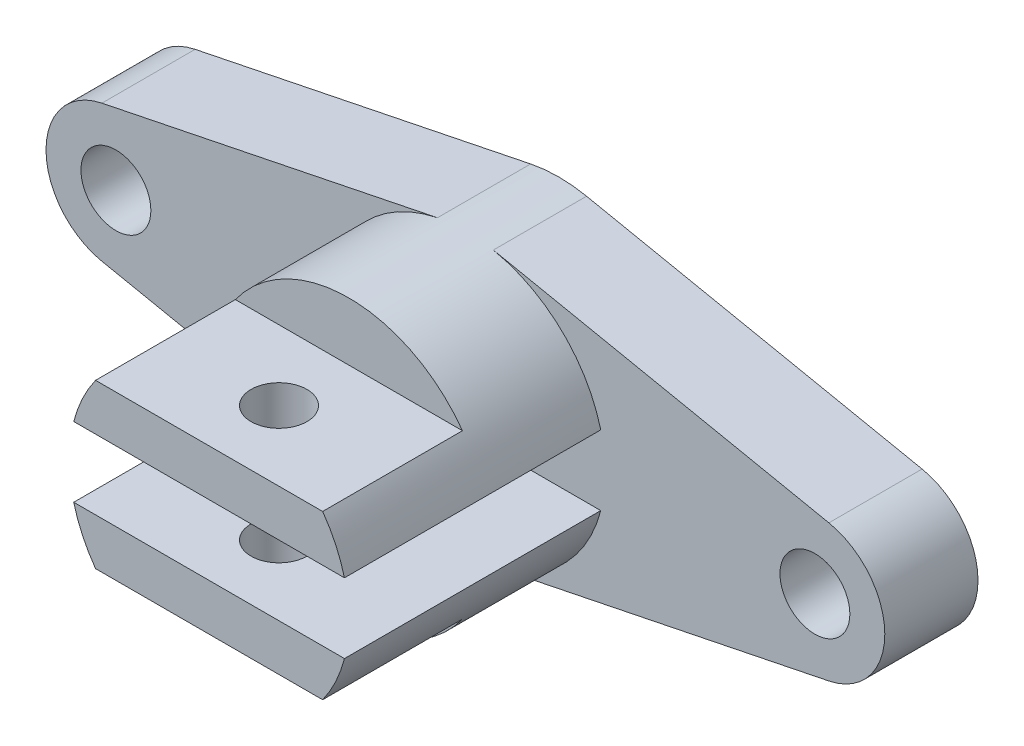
ISO-10303-21;
HEADER;
FILE_DESCRIPTION(('STEP AP214'),'2;1');
FILE_NAME('part.step','',(''),(''),'','','');
FILE_SCHEMA(('AUTOMOTIVE_DESIGN { 1 0 10303 214 1 1 1 1 }'));
ENDSEC;
DATA;
#1=APPLICATION_CONTEXT('core data for automotive mechanical design processes');
#2=APPLICATION_PROTOCOL_DEFINITION('international standard','automotive_design',2000,#1);
#3=PRODUCT_CONTEXT('',#1,'mechanical');
#4=PRODUCT('Part','Part','',(#3));
#5=PRODUCT_RELATED_PRODUCT_CATEGORY('part','',(#4));
#6=PRODUCT_DEFINITION_FORMATION('','',#4);
#7=PRODUCT_DEFINITION_CONTEXT('part definition',#1,'design');
#8=PRODUCT_DEFINITION('design','',#6,#7);
#9=PRODUCT_DEFINITION_SHAPE('','',#8);
#10=(LENGTH_UNIT() NAMED_UNIT(*) SI_UNIT(.MILLI.,.METRE.));
#11=(NAMED_UNIT(*) PLANE_ANGLE_UNIT() SI_UNIT($,.RADIAN.));
#12=(NAMED_UNIT(*) SI_UNIT($,.STERADIAN.) SOLID_ANGLE_UNIT());
#13=UNCERTAINTY_MEASURE_WITH_UNIT(LENGTH_MEASURE(1.E-05),#10,'distance_accuracy_value','');
#14=(GEOMETRIC_REPRESENTATION_CONTEXT(3) GLOBAL_UNCERTAINTY_ASSIGNED_CONTEXT((#13)) GLOBAL_UNIT_ASSIGNED_CONTEXT((#10,
#11,#12)) REPRESENTATION_CONTEXT('',''));
#15=CARTESIAN_POINT('',(0.,0.,0.));
#16=DIRECTION('',(0.,0.,1.));
#17=DIRECTION('',(1.,0.,0.));
#18=AXIS2_PLACEMENT_3D('',#15,#16,#17);
#19=CARTESIAN_POINT('',(0.,0.,45.));
#20=DIRECTION('',(0.,0.,1.));
#21=DIRECTION('',(1.,0.,0.));
#22=AXIS2_PLACEMENT_3D('',#19,#20,#21);
#23=PLANE('',#22);
#24=CARTESIAN_POINT('',(0.,0.,45.));
#25=DIRECTION('',(0.,0.,1.));
#26=DIRECTION('',(1.,0.,0.));
#27=AXIS2_PLACEMENT_3D('',#24,#25,#26);
#28=CIRCLE('',#27,29.9999999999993);
#29=CARTESIAN_POINT('',(-24.3669858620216,-17.5000000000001,45.));
#30=VERTEX_POINT('',#29);
#31=CARTESIAN_POINT('',(24.3669858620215,-17.5000000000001,45.));
#32=VERTEX_POINT('',#31);
#33=EDGE_CURVE('E228',#30,#32,#28,.T.);
#34=ORIENTED_EDGE('',*,*,#33,.T.);
#35=DIRECTION('',(-1.,0.,0.));
#36=VECTOR('',#35,1.);
#37=CARTESIAN_POINT('',(0.,-17.5000000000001,45.));
#38=LINE('',#37,#36);
#39=EDGE_CURVE('E11',#32,#30,#38,.T.);
#40=ORIENTED_EDGE('',*,*,#39,.T.);
#41=EDGE_LOOP('',(#34,#40));
#42=FACE_BOUND('',#41,.T.);
#43=ADVANCED_FACE('F47',(#42),#23,.T.);
#44=CARTESIAN_POINT('',(0.,0.,20.));
#45=DIRECTION('',(0.,0.,-1.));
#46=DIRECTION('',(-1.,0.,0.));
#47=AXIS2_PLACEMENT_3D('',#44,#45,#46);
#48=CYLINDRICAL_SURFACE('',#47,29.9999999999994);
#49=CARTESIAN_POINT('',(0.,0.,45.));
#50=DIRECTION('',(0.,0.,1.));
#51=DIRECTION('',(1.,0.,0.));
#52=AXIS2_PLACEMENT_3D('',#49,#50,#51);
#53=CIRCLE('',#52,29.9999999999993);
#54=CARTESIAN_POINT('',(24.3669858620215,17.5,45.));
#55=VERTEX_POINT('',#54);
#56=CARTESIAN_POINT('',(-24.3669858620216,17.5,45.));
#57=VERTEX_POINT('',#56);
#58=EDGE_CURVE('E174',#55,#57,#53,.T.);
#59=ORIENTED_EDGE('',*,*,#58,.F.);
#60=DIRECTION('',(0.,0.,-1.));
#61=VECTOR('',#60,1.);
#62=CARTESIAN_POINT('',(24.3669858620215,17.5,75.));
#63=LINE('',#62,#61);
#64=CARTESIAN_POINT('',(24.3669858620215,17.5,75.));
#65=VERTEX_POINT('',#64);
#66=EDGE_CURVE('E205',#65,#55,#63,.T.);
#67=ORIENTED_EDGE('',*,*,#66,.F.);
#68=CARTESIAN_POINT('',(0.,0.,75.));
#69=DIRECTION('',(0.,0.,1.));
#70=DIRECTION('',(1.,0.,0.));
#71=AXIS2_PLACEMENT_3D('',#68,#69,#70);
#72=CIRCLE('',#71,29.9999999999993);
#73=CARTESIAN_POINT('',(29.0473750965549,7.5,75.));
#74=VERTEX_POINT('',#73);
#75=EDGE_CURVE('E182',#74,#65,#72,.T.);
#76=ORIENTED_EDGE('',*,*,#75,.F.);
#77=DIRECTION('',(0.,0.,-1.));
#78=VECTOR('',#77,1.);
#79=CARTESIAN_POINT('',(29.0473750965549,7.50000000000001,45.));
#80=LINE('',#79,#78);
#81=CARTESIAN_POINT('',(29.0473750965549,7.50000000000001,20.));
#82=VERTEX_POINT('',#81);
#83=EDGE_CURVE('E173',#74,#82,#80,.T.);
#84=ORIENTED_EDGE('',*,*,#83,.T.);
#85=CARTESIAN_POINT('',(0.,0.,20.));
#86=DIRECTION('',(0.,0.,1.));
#87=DIRECTION('',(1.,0.,0.));
#88=AXIS2_PLACEMENT_3D('',#85,#86,#87);
#89=CIRCLE('',#88,29.9999999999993);
#90=CARTESIAN_POINT('',(5.99999999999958,29.3938769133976,20.));
#91=VERTEX_POINT('',#90);
#92=EDGE_CURVE('E70',#91,#82,#89,.F.);
#93=ORIENTED_EDGE('',*,*,#92,.F.);
#94=DIRECTION('',(0.,0.,-1.));
#95=VECTOR('',#94,1.);
#96=CARTESIAN_POINT('',(5.99999999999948,29.3938769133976,20.));
#97=LINE('',#96,#95);
#98=CARTESIAN_POINT('',(5.99999999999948,29.3938769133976,0.));
#99=VERTEX_POINT('',#98);
#100=EDGE_CURVE('E295',#91,#99,#97,.T.);
#101=ORIENTED_EDGE('',*,*,#100,.T.);
#102=CARTESIAN_POINT('',(0.,0.,0.));
#103=DIRECTION('',(0.,0.,1.));
#104=DIRECTION('',(1.,0.,0.));
#105=AXIS2_PLACEMENT_3D('',#102,#103,#104);
#106=CIRCLE('',#105,29.9999999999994);
#107=CARTESIAN_POINT('',(-6.00000000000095,29.3938769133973,0.));
#108=VERTEX_POINT('',#107);
#109=EDGE_CURVE('E268',#99,#108,#106,.T.);
#110=ORIENTED_EDGE('',*,*,#109,.T.);
#111=DIRECTION('',(0.,0.,-1.));
#112=VECTOR('',#111,1.);
#113=CARTESIAN_POINT('',(-6.00000000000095,29.3938769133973,20.));
#114=LINE('',#113,#112);
#115=CARTESIAN_POINT('',(-6.00000000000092,29.3938769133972,20.));
#116=VERTEX_POINT('',#115);
#117=EDGE_CURVE('E346',#116,#108,#114,.T.);
#118=ORIENTED_EDGE('',*,*,#117,.F.);
#119=CARTESIAN_POINT('',(-29.0473750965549,7.5,20.));
#120=VERTEX_POINT('',#119);
#121=EDGE_CURVE('E169',#120,#116,#89,.F.);
#122=ORIENTED_EDGE('',*,*,#121,.F.);
#123=DIRECTION('',(0.,0.,-1.));
#124=VECTOR('',#123,1.);
#125=CARTESIAN_POINT('',(-29.0473750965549,7.5,45.));
#126=LINE('',#125,#124);
#127=CARTESIAN_POINT('',(-29.0473750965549,7.5,75.));
#128=VERTEX_POINT('',#127);
#129=EDGE_CURVE('E162',#128,#120,#126,.T.);
#130=ORIENTED_EDGE('',*,*,#129,.F.);
#131=CARTESIAN_POINT('',(0.,0.,75.));
#132=DIRECTION('',(0.,0.,1.));
#133=DIRECTION('',(1.,0.,0.));
#134=AXIS2_PLACEMENT_3D('',#131,#132,#133);
#135=CIRCLE('',#134,29.9999999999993);
#136=CARTESIAN_POINT('',(-24.3669858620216,17.5,75.));
#137=VERTEX_POINT('',#136);
#138=EDGE_CURVE('E166',#137,#128,#135,.T.);
#139=ORIENTED_EDGE('',*,*,#138,.F.);
#140=DIRECTION('',(0.,0.,-1.));
#141=VECTOR('',#140,1.);
#142=CARTESIAN_POINT('',(-24.3669858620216,17.5,75.));
#143=LINE('',#142,#141);
#144=EDGE_CURVE('E202',#137,#57,#143,.T.);
#145=ORIENTED_EDGE('',*,*,#144,.T.);
#146=EDGE_LOOP('',(#59,#67,#76,#84,#93,#101,#110,#118,#122,#130,#139,#145));
#147=FACE_BOUND('',#146,.T.);
#148=ADVANCED_FACE('F49',(#147),#48,.T.);
#149=CARTESIAN_POINT('',(-78.0000000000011,14.6969384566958,20.));
#150=DIRECTION('',(-0.200000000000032,0.979795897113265,0.));
#151=DIRECTION('',(-0.979795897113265,-0.200000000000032,0.));
#152=AXIS2_PLACEMENT_3D('',#149,#150,#151);
#153=PLANE('',#152);
#154=DIRECTION('',(0.979795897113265,0.200000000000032,0.));
#155=VECTOR('',#154,1.);
#156=CARTESIAN_POINT('',(-78.0000000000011,14.6969384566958,0.));
#157=LINE('',#156,#155);
#158=CARTESIAN_POINT('',(-78.0000000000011,14.6969384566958,0.));
#159=VERTEX_POINT('',#158);
#160=EDGE_CURVE('E299',#159,#108,#157,.T.);
#161=ORIENTED_EDGE('',*,*,#160,.F.);
#162=DIRECTION('',(0.,0.,-1.));
#163=VECTOR('',#162,1.);
#164=CARTESIAN_POINT('',(-78.0000000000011,14.6969384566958,20.));
#165=LINE('',#164,#163);
#166=CARTESIAN_POINT('',(-78.0000000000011,14.6969384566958,20.));
#167=VERTEX_POINT('',#166);
#168=EDGE_CURVE('E343',#167,#159,#165,.T.);
#169=ORIENTED_EDGE('',*,*,#168,.F.);
#170=DIRECTION('',(0.979795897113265,0.200000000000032,0.));
#171=VECTOR('',#170,1.);
#172=CARTESIAN_POINT('',(-78.0000000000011,14.6969384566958,20.));
#173=LINE('',#172,#171);
#174=EDGE_CURVE('E272',#167,#116,#173,.T.);
#175=ORIENTED_EDGE('',*,*,#174,.T.);
#176=ORIENTED_EDGE('',*,*,#117,.T.);
#177=EDGE_LOOP('',(#161,#169,#175,#176));
#178=FACE_BOUND('',#177,.T.);
#179=ADVANCED_FACE('F375',(#178),#153,.T.);
#180=CARTESIAN_POINT('',(-75.0000000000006,-3.15973077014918E-12,20.));
#181=DIRECTION('',(0.,0.,-1.));
#182=DIRECTION('',(-1.,0.,0.));
#183=AXIS2_PLACEMENT_3D('',#180,#181,#182);
#184=CYLINDRICAL_SURFACE('',#183,15.);
#185=CARTESIAN_POINT('',(-75.0000000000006,-3.15973077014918E-12,0.));
#186=DIRECTION('',(0.,0.,1.));
#187=DIRECTION('',(1.,0.,0.));
#188=AXIS2_PLACEMENT_3D('',#185,#186,#187);
#189=CIRCLE('',#188,15.);
#190=CARTESIAN_POINT('',(-77.9999999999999,-14.6969384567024,0.));
#191=VERTEX_POINT('',#190);
#192=EDGE_CURVE('E303',#159,#191,#189,.T.);
#193=ORIENTED_EDGE('',*,*,#192,.T.);
#194=DIRECTION('',(0.,0.,-1.));
#195=VECTOR('',#194,1.);
#196=CARTESIAN_POINT('',(-77.9999999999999,-14.6969384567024,20.));
#197=LINE('',#196,#195);
#198=CARTESIAN_POINT('',(-77.9999999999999,-14.6969384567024,20.));
#199=VERTEX_POINT('',#198);
#200=EDGE_CURVE('E339',#199,#191,#197,.T.);
#201=ORIENTED_EDGE('',*,*,#200,.F.);
#202=CARTESIAN_POINT('',(-75.0000000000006,-3.15973077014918E-12,20.));
#203=DIRECTION('',(0.,0.,1.));
#204=DIRECTION('',(1.,0.,0.));
#205=AXIS2_PLACEMENT_3D('',#202,#203,#204);
#206=CIRCLE('',#205,15.);
#207=EDGE_CURVE('E276',#167,#199,#206,.T.);
#208=ORIENTED_EDGE('',*,*,#207,.F.);
#209=ORIENTED_EDGE('',*,*,#168,.T.);
#210=EDGE_LOOP('',(#193,#201,#208,#209));
#211=FACE_BOUND('',#210,.T.);
#212=ADVANCED_FACE('F411',(#211),#184,.T.);
#213=CARTESIAN_POINT('',(-77.9999999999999,-14.6969384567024,20.));
#214=DIRECTION('',(0.199999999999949,0.979795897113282,0.));
#215=DIRECTION('',(-0.979795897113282,0.199999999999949,0.));
#216=AXIS2_PLACEMENT_3D('',#213,#214,#215);
#217=PLANE('',#216);
#218=DIRECTION('',(0.979795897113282,-0.199999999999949,0.));
#219=VECTOR('',#218,1.);
#220=CARTESIAN_POINT('',(-77.9999999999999,-14.6969384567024,0.));
#221=LINE('',#220,#219);
#222=CARTESIAN_POINT('',(-5.99999999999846,-29.3938769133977,0.));
#223=VERTEX_POINT('',#222);
#224=EDGE_CURVE('E306',#191,#223,#221,.T.);
#225=ORIENTED_EDGE('',*,*,#224,.T.);
#226=DIRECTION('',(0.,0.,-1.));
#227=VECTOR('',#226,1.);
#228=CARTESIAN_POINT('',(-5.99999999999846,-29.3938769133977,20.));
#229=LINE('',#228,#227);
#230=CARTESIAN_POINT('',(-5.99999999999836,-29.3938769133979,20.));
#231=VERTEX_POINT('',#230);
#232=EDGE_CURVE('E335',#231,#223,#229,.T.);
#233=ORIENTED_EDGE('',*,*,#232,.F.);
#234=DIRECTION('',(0.979795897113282,-0.199999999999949,0.));
#235=VECTOR('',#234,1.);
#236=CARTESIAN_POINT('',(-77.9999999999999,-14.6969384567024,20.));
#237=LINE('',#236,#235);
#238=EDGE_CURVE('E280',#199,#231,#237,.T.);
#239=ORIENTED_EDGE('',*,*,#238,.F.);
#240=ORIENTED_EDGE('',*,*,#200,.T.);
#241=EDGE_LOOP('',(#225,#233,#239,#240));
#242=FACE_BOUND('',#241,.T.);
#243=ADVANCED_FACE('F407',(#242),#217,.F.);
#244=CARTESIAN_POINT('',(0.,0.,20.));
#245=DIRECTION('',(0.,0.,-1.));
#246=DIRECTION('',(-1.,0.,0.));
#247=AXIS2_PLACEMENT_3D('',#244,#245,#246);
#248=CYLINDRICAL_SURFACE('',#247,29.9999999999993);
#249=DIRECTION('',(0.,0.,-1.));
#250=VECTOR('',#249,1.);
#251=CARTESIAN_POINT('',(-29.0473750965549,-7.49999999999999,45.));
#252=LINE('',#251,#250);
#253=CARTESIAN_POINT('',(-29.0473750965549,-7.5,75.));
#254=VERTEX_POINT('',#253);
#255=CARTESIAN_POINT('',(-29.0473750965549,-7.49999999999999,20.));
#256=VERTEX_POINT('',#255);
#257=EDGE_CURVE('E209',#254,#256,#252,.T.);
#258=ORIENTED_EDGE('',*,*,#257,.T.);
#259=CARTESIAN_POINT('',(0.,0.,20.));
#260=DIRECTION('',(0.,0.,1.));
#261=DIRECTION('',(1.,0.,0.));
#262=AXIS2_PLACEMENT_3D('',#259,#260,#261);
#263=CIRCLE('',#262,29.9999999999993);
#264=EDGE_CURVE('E245',#231,#256,#263,.F.);
#265=ORIENTED_EDGE('',*,*,#264,.F.);
#266=ORIENTED_EDGE('',*,*,#232,.T.);
#267=CARTESIAN_POINT('',(0.,0.,0.));
#268=DIRECTION('',(0.,0.,1.));
#269=DIRECTION('',(1.,0.,0.));
#270=AXIS2_PLACEMENT_3D('',#267,#268,#269);
#271=CIRCLE('',#270,29.9999999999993);
#272=CARTESIAN_POINT('',(5.99999999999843,-29.3938769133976,0.));
#273=VERTEX_POINT('',#272);
#274=EDGE_CURVE('E309',#223,#273,#271,.T.);
#275=ORIENTED_EDGE('',*,*,#274,.T.);
#276=DIRECTION('',(0.,0.,-1.));
#277=VECTOR('',#276,1.);
#278=CARTESIAN_POINT('',(5.99999999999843,-29.3938769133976,20.));
#279=LINE('',#278,#277);
#280=CARTESIAN_POINT('',(5.99999999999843,-29.3938769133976,20.));
#281=VERTEX_POINT('',#280);
#282=EDGE_CURVE('E332',#281,#273,#279,.T.);
#283=ORIENTED_EDGE('',*,*,#282,.F.);
#284=CARTESIAN_POINT('',(29.0473750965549,-7.50000000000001,20.));
#285=VERTEX_POINT('',#284);
#286=EDGE_CURVE('E232',#285,#281,#263,.F.);
#287=ORIENTED_EDGE('',*,*,#286,.F.);
#288=DIRECTION('',(0.,0.,-1.));
#289=VECTOR('',#288,1.);
#290=CARTESIAN_POINT('',(29.0473750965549,-7.50000000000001,45.));
#291=LINE('',#290,#289);
#292=CARTESIAN_POINT('',(29.0473750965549,-7.5,75.));
#293=VERTEX_POINT('',#292);
#294=EDGE_CURVE('E233',#293,#285,#291,.T.);
#295=ORIENTED_EDGE('',*,*,#294,.F.);
#296=CARTESIAN_POINT('',(0.,0.,75.));
#297=DIRECTION('',(0.,0.,1.));
#298=DIRECTION('',(1.,0.,0.));
#299=AXIS2_PLACEMENT_3D('',#296,#297,#298);
#300=CIRCLE('',#299,29.9999999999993);
#301=CARTESIAN_POINT('',(24.3669858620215,-17.5000000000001,75.));
#302=VERTEX_POINT('',#301);
#303=EDGE_CURVE('E221',#302,#293,#300,.T.);
#304=ORIENTED_EDGE('',*,*,#303,.F.);
#305=DIRECTION('',(0.,0.,-1.));
#306=VECTOR('',#305,1.);
#307=CARTESIAN_POINT('',(24.3669858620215,-17.5000000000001,75.));
#308=LINE('',#307,#306);
#309=EDGE_CURVE('E213',#302,#32,#308,.T.);
#310=ORIENTED_EDGE('',*,*,#309,.T.);
#311=ORIENTED_EDGE('',*,*,#33,.F.);
#312=DIRECTION('',(0.,0.,-1.));
#313=VECTOR('',#312,1.);
#314=CARTESIAN_POINT('',(-24.3669858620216,-17.5000000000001,75.));
#315=LINE('',#314,#313);
#316=CARTESIAN_POINT('',(-24.3669858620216,-17.5000000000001,75.));
#317=VERTEX_POINT('',#316);
#318=EDGE_CURVE('E210',#317,#30,#315,.T.);
#319=ORIENTED_EDGE('',*,*,#318,.F.);
#320=CARTESIAN_POINT('',(0.,0.,75.));
#321=DIRECTION('',(0.,0.,1.));
#322=DIRECTION('',(1.,0.,0.));
#323=AXIS2_PLACEMENT_3D('',#320,#321,#322);
#324=CIRCLE('',#323,29.9999999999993);
#325=EDGE_CURVE('E188',#254,#317,#324,.T.);
#326=ORIENTED_EDGE('',*,*,#325,.F.);
#327=EDGE_LOOP('',(#258,#265,#266,#275,#283,#287,#295,#304,#310,#311,#319,#326));
#328=FACE_BOUND('',#327,.T.);
#329=ADVANCED_FACE('F403',(#328),#248,.T.);
#330=CARTESIAN_POINT('',(78.0000000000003,-14.6969384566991,20.));
#331=DIRECTION('',(0.199999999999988,-0.979795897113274,0.));
#332=DIRECTION('',(0.979795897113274,0.199999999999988,0.));
#333=AXIS2_PLACEMENT_3D('',#330,#331,#332);
#334=PLANE('',#333);
#335=DIRECTION('',(-0.979795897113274,-0.199999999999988,0.));
#336=VECTOR('',#335,1.);
#337=CARTESIAN_POINT('',(78.0000000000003,-14.6969384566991,0.));
#338=LINE('',#337,#336);
#339=CARTESIAN_POINT('',(78.0000000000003,-14.6969384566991,0.));
#340=VERTEX_POINT('',#339);
#341=EDGE_CURVE('E313',#340,#273,#338,.T.);
#342=ORIENTED_EDGE('',*,*,#341,.F.);
#343=DIRECTION('',(0.,0.,-1.));
#344=VECTOR('',#343,1.);
#345=CARTESIAN_POINT('',(78.0000000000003,-14.6969384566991,20.));
#346=LINE('',#345,#344);
#347=CARTESIAN_POINT('',(78.0000000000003,-14.6969384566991,20.));
#348=VERTEX_POINT('',#347);
#349=EDGE_CURVE('E329',#348,#340,#346,.T.);
#350=ORIENTED_EDGE('',*,*,#349,.F.);
#351=DIRECTION('',(-0.979795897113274,-0.199999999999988,0.));
#352=VECTOR('',#351,1.);
#353=CARTESIAN_POINT('',(78.0000000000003,-14.6969384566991,20.));
#354=LINE('',#353,#352);
#355=EDGE_CURVE('E284',#348,#281,#354,.T.);
#356=ORIENTED_EDGE('',*,*,#355,.T.);
#357=ORIENTED_EDGE('',*,*,#282,.T.);
#358=EDGE_LOOP('',(#342,#350,#356,#357));
#359=FACE_BOUND('',#358,.T.);
#360=ADVANCED_FACE('F399',(#359),#334,.T.);
#361=CARTESIAN_POINT('',(74.9999999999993,0.,20.));
#362=DIRECTION('',(0.,0.,-1.));
#363=DIRECTION('',(-1.,0.,0.));
#364=AXIS2_PLACEMENT_3D('',#361,#362,#363);
#365=CYLINDRICAL_SURFACE('',#364,15.0000000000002);
#366=CARTESIAN_POINT('',(74.9999999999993,0.,0.));
#367=DIRECTION('',(0.,0.,1.));
#368=DIRECTION('',(1.,0.,0.));
#369=AXIS2_PLACEMENT_3D('',#366,#367,#368);
#370=CIRCLE('',#369,15.0000000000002);
#371=CARTESIAN_POINT('',(78.0000000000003,14.6969384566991,0.));
#372=VERTEX_POINT('',#371);
#373=EDGE_CURVE('E317',#340,#372,#370,.T.);
#374=ORIENTED_EDGE('',*,*,#373,.T.);
#375=DIRECTION('',(0.,0.,-1.));
#376=VECTOR('',#375,1.);
#377=CARTESIAN_POINT('',(78.0000000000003,14.6969384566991,20.));
#378=LINE('',#377,#376);
#379=CARTESIAN_POINT('',(78.0000000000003,14.6969384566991,20.));
#380=VERTEX_POINT('',#379);
#381=EDGE_CURVE('E326',#380,#372,#378,.T.);
#382=ORIENTED_EDGE('',*,*,#381,.F.);
#383=CARTESIAN_POINT('',(74.9999999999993,0.,20.));
#384=DIRECTION('',(0.,0.,1.));
#385=DIRECTION('',(1.,0.,0.));
#386=AXIS2_PLACEMENT_3D('',#383,#384,#385);
#387=CIRCLE('',#386,15.0000000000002);
#388=EDGE_CURVE('E288',#348,#380,#387,.T.);
#389=ORIENTED_EDGE('',*,*,#388,.F.);
#390=ORIENTED_EDGE('',*,*,#349,.T.);
#391=EDGE_LOOP('',(#374,#382,#389,#390));
#392=FACE_BOUND('',#391,.T.);
#393=ADVANCED_FACE('F395',(#392),#365,.T.);
#394=CARTESIAN_POINT('',(5.99999999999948,29.3938769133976,20.));
#395=DIRECTION('',(0.19999999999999,0.979795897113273,0.));
#396=DIRECTION('',(-0.979795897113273,0.19999999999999,0.));
#397=AXIS2_PLACEMENT_3D('',#394,#395,#396);
#398=PLANE('',#397);
#399=DIRECTION('',(0.979795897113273,-0.19999999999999,0.));
#400=VECTOR('',#399,1.);
#401=CARTESIAN_POINT('',(5.99999999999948,29.3938769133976,0.));
#402=LINE('',#401,#400);
#403=EDGE_CURVE('E277',#99,#372,#402,.T.);
#404=ORIENTED_EDGE('',*,*,#403,.F.);
#405=ORIENTED_EDGE('',*,*,#100,.F.);
#406=DIRECTION('',(0.979795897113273,-0.19999999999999,0.));
#407=VECTOR('',#406,1.);
#408=CARTESIAN_POINT('',(5.99999999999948,29.3938769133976,20.));
#409=LINE('',#408,#407);
#410=EDGE_CURVE('E291',#91,#380,#409,.T.);
#411=ORIENTED_EDGE('',*,*,#410,.T.);
#412=ORIENTED_EDGE('',*,*,#381,.T.);
#413=EDGE_LOOP('',(#404,#405,#411,#412));
#414=FACE_BOUND('',#413,.T.);
#415=ADVANCED_FACE('F390',(#414),#398,.T.);
#416=CARTESIAN_POINT('',(0.,0.,20.));
#417=DIRECTION('',(0.,0.,1.));
#418=DIRECTION('',(1.,0.,0.));
#419=AXIS2_PLACEMENT_3D('',#416,#417,#418);
#420=PLANE('',#419);
#421=CARTESIAN_POINT('',(74.9999999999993,0.,20.));
#422=DIRECTION('',(0.,0.,1.));
#423=DIRECTION('',(1.,0.,0.));
#424=AXIS2_PLACEMENT_3D('',#421,#422,#423);
#425=CIRCLE('',#424,7.50000000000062);
#426=CARTESIAN_POINT('',(82.5,0.,20.));
#427=VERTEX_POINT('',#426);
#428=EDGE_CURVE('E256',#427,#427,#425,.T.);
#429=ORIENTED_EDGE('',*,*,#428,.F.);
#430=EDGE_LOOP('',(#429));
#431=FACE_BOUND('',#430,.T.);
#432=CARTESIAN_POINT('',(-75.0000000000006,-3.15973077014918E-12,20.));
#433=DIRECTION('',(0.,0.,1.));
#434=DIRECTION('',(1.,0.,0.));
#435=AXIS2_PLACEMENT_3D('',#432,#433,#434);
#436=CIRCLE('',#435,7.50000000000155);
#437=CARTESIAN_POINT('',(-67.4999999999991,-3.15973077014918E-12,20.));
#438=VERTEX_POINT('',#437);
#439=EDGE_CURVE('E264',#438,#438,#436,.T.);
#440=ORIENTED_EDGE('',*,*,#439,.F.);
#441=EDGE_LOOP('',(#440));
#442=FACE_BOUND('',#441,.T.);
#443=DIRECTION('',(-1.,0.,0.));
#444=VECTOR('',#443,1.);
#445=CARTESIAN_POINT('',(0.,7.5,20.));
#446=LINE('',#445,#444);
#447=EDGE_CURVE('E252',#82,#120,#446,.T.);
#448=ORIENTED_EDGE('',*,*,#447,.T.);
#449=ORIENTED_EDGE('',*,*,#121,.T.);
#450=ORIENTED_EDGE('',*,*,#174,.F.);
#451=ORIENTED_EDGE('',*,*,#207,.T.);
#452=ORIENTED_EDGE('',*,*,#238,.T.);
#453=ORIENTED_EDGE('',*,*,#264,.T.);
#454=DIRECTION('',(-1.,0.,0.));
#455=VECTOR('',#454,1.);
#456=CARTESIAN_POINT('',(0.,-7.5,20.));
#457=LINE('',#456,#455);
#458=EDGE_CURVE('E246',#285,#256,#457,.T.);
#459=ORIENTED_EDGE('',*,*,#458,.F.);
#460=ORIENTED_EDGE('',*,*,#286,.T.);
#461=ORIENTED_EDGE('',*,*,#355,.F.);
#462=ORIENTED_EDGE('',*,*,#388,.T.);
#463=ORIENTED_EDGE('',*,*,#410,.F.);
#464=ORIENTED_EDGE('',*,*,#92,.T.);
#465=EDGE_LOOP('',(#448,#449,#450,#451,#452,#453,#459,#460,#461,#462,#463,#464));
#466=FACE_BOUND('',#465,.T.);
#467=ADVANCED_FACE('F387',(#431,#442,#466),#420,.T.);
#468=CARTESIAN_POINT('',(0.,0.,0.));
#469=DIRECTION('',(0.,0.,1.));
#470=DIRECTION('',(1.,0.,0.));
#471=AXIS2_PLACEMENT_3D('',#468,#469,#470);
#472=PLANE('',#471);
#473=ORIENTED_EDGE('',*,*,#160,.T.);
#474=ORIENTED_EDGE('',*,*,#109,.F.);
#475=ORIENTED_EDGE('',*,*,#403,.T.);
#476=ORIENTED_EDGE('',*,*,#373,.F.);
#477=ORIENTED_EDGE('',*,*,#341,.T.);
#478=ORIENTED_EDGE('',*,*,#274,.F.);
#479=ORIENTED_EDGE('',*,*,#224,.F.);
#480=ORIENTED_EDGE('',*,*,#192,.F.);
#481=EDGE_LOOP('',(#473,#474,#475,#476,#477,#478,#479,#480));
#482=FACE_BOUND('',#481,.T.);
#483=CARTESIAN_POINT('',(74.9999999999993,0.,0.));
#484=DIRECTION('',(0.,0.,1.));
#485=DIRECTION('',(1.,0.,0.));
#486=AXIS2_PLACEMENT_3D('',#483,#484,#485);
#487=CIRCLE('',#486,7.50000000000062);
#488=CARTESIAN_POINT('',(82.5,0.,0.));
#489=VERTEX_POINT('',#488);
#490=EDGE_CURVE('E255',#489,#489,#487,.T.);
#491=ORIENTED_EDGE('',*,*,#490,.T.);
#492=EDGE_LOOP('',(#491));
#493=FACE_BOUND('',#492,.T.);
#494=CARTESIAN_POINT('',(-75.0000000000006,-3.15973077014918E-12,0.));
#495=DIRECTION('',(0.,0.,1.));
#496=DIRECTION('',(1.,0.,0.));
#497=AXIS2_PLACEMENT_3D('',#494,#495,#496);
#498=CIRCLE('',#497,7.50000000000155);
#499=CARTESIAN_POINT('',(-67.4999999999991,-3.15973077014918E-12,0.));
#500=VERTEX_POINT('',#499);
#501=EDGE_CURVE('E260',#500,#500,#498,.T.);
#502=ORIENTED_EDGE('',*,*,#501,.T.);
#503=EDGE_LOOP('',(#502));
#504=FACE_BOUND('',#503,.T.);
#505=ADVANCED_FACE('F385',(#482,#493,#504),#472,.F.);
#506=CARTESIAN_POINT('',(-75.0000000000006,-3.15973077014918E-12,20.));
#507=DIRECTION('',(0.,0.,-1.));
#508=DIRECTION('',(-1.,0.,0.));
#509=AXIS2_PLACEMENT_3D('',#506,#507,#508);
#510=CYLINDRICAL_SURFACE('',#509,7.50000000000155);
#511=ORIENTED_EDGE('',*,*,#439,.T.);
#512=EDGE_LOOP('',(#511));
#513=FACE_BOUND('',#512,.T.);
#514=ORIENTED_EDGE('',*,*,#501,.F.);
#515=EDGE_LOOP('',(#514));
#516=FACE_BOUND('',#515,.T.);
#517=ADVANCED_FACE('F381',(#513,#516),#510,.F.);
#518=CARTESIAN_POINT('',(74.9999999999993,0.,20.));
#519=DIRECTION('',(0.,0.,-1.));
#520=DIRECTION('',(-1.,0.,0.));
#521=AXIS2_PLACEMENT_3D('',#518,#519,#520);
#522=CYLINDRICAL_SURFACE('',#521,7.50000000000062);
#523=ORIENTED_EDGE('',*,*,#428,.T.);
#524=EDGE_LOOP('',(#523));
#525=FACE_BOUND('',#524,.T.);
#526=ORIENTED_EDGE('',*,*,#490,.F.);
#527=EDGE_LOOP('',(#526));
#528=FACE_BOUND('',#527,.T.);
#529=ADVANCED_FACE('F378',(#525,#528),#522,.F.);
#530=CARTESIAN_POINT('',(-29.0473750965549,-7.5,45.));
#531=DIRECTION('',(0.,1.,0.));
#532=DIRECTION('',(0.,0.,1.));
#533=AXIS2_PLACEMENT_3D('',#530,#531,#532);
#534=PLANE('',#533);
#535=CARTESIAN_POINT('',(0.,-7.49999999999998,60.));
#536=DIRECTION('',(0.,1.,0.));
#537=DIRECTION('',(0.,0.,1.));
#538=AXIS2_PLACEMENT_3D('',#535,#536,#537);
#539=CIRCLE('',#538,6.);
#540=CARTESIAN_POINT('',(0.,-7.49999999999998,54.));
#541=VERTEX_POINT('',#540);
#542=EDGE_CURVE('E195',#541,#541,#539,.F.);
#543=ORIENTED_EDGE('',*,*,#542,.T.);
#544=EDGE_LOOP('',(#543));
#545=FACE_BOUND('',#544,.T.);
#546=ORIENTED_EDGE('',*,*,#294,.T.);
#547=ORIENTED_EDGE('',*,*,#458,.T.);
#548=ORIENTED_EDGE('',*,*,#257,.F.);
#549=DIRECTION('',(1.,0.,0.));
#550=VECTOR('',#549,1.);
#551=CARTESIAN_POINT('',(-29.0473750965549,-7.5,75.));
#552=LINE('',#551,#550);
#553=EDGE_CURVE('E217',#254,#293,#552,.T.);
#554=ORIENTED_EDGE('',*,*,#553,.T.);
#555=EDGE_LOOP('',(#546,#547,#548,#554));
#556=FACE_BOUND('',#555,.T.);
#557=ADVANCED_FACE('F364',(#545,#556),#534,.T.);
#558=CARTESIAN_POINT('',(-29.0473750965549,7.5,45.));
#559=DIRECTION('',(0.,1.,0.));
#560=DIRECTION('',(0.,0.,1.));
#561=AXIS2_PLACEMENT_3D('',#558,#559,#560);
#562=PLANE('',#561);
#563=CARTESIAN_POINT('',(0.,7.5,60.));
#564=DIRECTION('',(0.,1.,0.));
#565=DIRECTION('',(0.,0.,1.));
#566=AXIS2_PLACEMENT_3D('',#563,#564,#565);
#567=CIRCLE('',#566,6.);
#568=CARTESIAN_POINT('',(0.,7.5,54.));
#569=VERTEX_POINT('',#568);
#570=EDGE_CURVE('E475',#569,#569,#567,.F.);
#571=ORIENTED_EDGE('',*,*,#570,.F.);
#572=EDGE_LOOP('',(#571));
#573=FACE_BOUND('',#572,.T.);
#574=ORIENTED_EDGE('',*,*,#447,.F.);
#575=ORIENTED_EDGE('',*,*,#83,.F.);
#576=DIRECTION('',(1.,0.,0.));
#577=VECTOR('',#576,1.);
#578=CARTESIAN_POINT('',(-29.0473750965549,7.5,75.));
#579=LINE('',#578,#577);
#580=EDGE_CURVE('E177',#128,#74,#579,.T.);
#581=ORIENTED_EDGE('',*,*,#580,.F.);
#582=ORIENTED_EDGE('',*,*,#129,.T.);
#583=EDGE_LOOP('',(#574,#575,#581,#582));
#584=FACE_BOUND('',#583,.T.);
#585=ADVANCED_FACE('F178',(#573,#584),#562,.F.);
#586=CARTESIAN_POINT('',(0.,0.,45.));
#587=DIRECTION('',(0.,0.,1.));
#588=DIRECTION('',(1.,0.,0.));
#589=AXIS2_PLACEMENT_3D('',#586,#587,#588);
#590=PLANE('',#589);
#591=DIRECTION('',(-1.,0.,0.));
#592=VECTOR('',#591,1.);
#593=CARTESIAN_POINT('',(0.,17.5,45.));
#594=LINE('',#593,#592);
#595=EDGE_CURVE('E57',#55,#57,#594,.T.);
#596=ORIENTED_EDGE('',*,*,#595,.F.);
#597=ORIENTED_EDGE('',*,*,#58,.T.);
#598=EDGE_LOOP('',(#596,#597));
#599=FACE_BOUND('',#598,.T.);
#600=ADVANCED_FACE('F353',(#599),#590,.T.);
#601=CARTESIAN_POINT('',(-24.3669858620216,17.5,75.));
#602=DIRECTION('',(0.,1.,0.));
#603=DIRECTION('',(0.,0.,1.));
#604=AXIS2_PLACEMENT_3D('',#601,#602,#603);
#605=PLANE('',#604);
#606=CARTESIAN_POINT('',(0.,17.5,60.));
#607=DIRECTION('',(0.,1.,0.));
#608=DIRECTION('',(0.,0.,1.));
#609=AXIS2_PLACEMENT_3D('',#606,#607,#608);
#610=CIRCLE('',#609,6.);
#611=CARTESIAN_POINT('',(0.,17.5,54.));
#612=VERTEX_POINT('',#611);
#613=EDGE_CURVE('E472',#612,#612,#610,.F.);
#614=ORIENTED_EDGE('',*,*,#613,.T.);
#615=EDGE_LOOP('',(#614));
#616=FACE_BOUND('',#615,.T.);
#617=ORIENTED_EDGE('',*,*,#66,.T.);
#618=ORIENTED_EDGE('',*,*,#595,.T.);
#619=ORIENTED_EDGE('',*,*,#144,.F.);
#620=DIRECTION('',(1.,0.,0.));
#621=VECTOR('',#620,1.);
#622=CARTESIAN_POINT('',(-24.3669858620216,17.5,75.));
#623=LINE('',#622,#621);
#624=EDGE_CURVE('E186',#137,#65,#623,.T.);
#625=ORIENTED_EDGE('',*,*,#624,.T.);
#626=EDGE_LOOP('',(#617,#618,#619,#625));
#627=FACE_BOUND('',#626,.T.);
#628=ADVANCED_FACE('F351',(#616,#627),#605,.T.);
#629=CARTESIAN_POINT('',(0.,0.,75.));
#630=DIRECTION('',(0.,0.,1.));
#631=DIRECTION('',(1.,0.,0.));
#632=AXIS2_PLACEMENT_3D('',#629,#630,#631);
#633=PLANE('',#632);
#634=ORIENTED_EDGE('',*,*,#138,.T.);
#635=ORIENTED_EDGE('',*,*,#580,.T.);
#636=ORIENTED_EDGE('',*,*,#75,.T.);
#637=ORIENTED_EDGE('',*,*,#624,.F.);
#638=EDGE_LOOP('',(#634,#635,#636,#637));
#639=FACE_BOUND('',#638,.T.);
#640=ADVANCED_FACE('F184',(#639),#633,.T.);
#641=CARTESIAN_POINT('',(-24.3669858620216,-17.5000000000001,75.));
#642=DIRECTION('',(0.,1.,0.));
#643=DIRECTION('',(0.,0.,1.));
#644=AXIS2_PLACEMENT_3D('',#641,#642,#643);
#645=PLANE('',#644);
#646=CARTESIAN_POINT('',(0.,-17.5000000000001,60.));
#647=DIRECTION('',(0.,1.,0.));
#648=DIRECTION('',(0.,0.,1.));
#649=AXIS2_PLACEMENT_3D('',#646,#647,#648);
#650=CIRCLE('',#649,6.);
#651=CARTESIAN_POINT('',(0.,-17.5000000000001,54.));
#652=VERTEX_POINT('',#651);
#653=EDGE_CURVE('E51',#652,#652,#650,.F.);
#654=ORIENTED_EDGE('',*,*,#653,.F.);
#655=EDGE_LOOP('',(#654));
#656=FACE_BOUND('',#655,.T.);
#657=ORIENTED_EDGE('',*,*,#39,.F.);
#658=ORIENTED_EDGE('',*,*,#309,.F.);
#659=DIRECTION('',(1.,0.,0.));
#660=VECTOR('',#659,1.);
#661=CARTESIAN_POINT('',(-24.3669858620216,-17.5000000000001,75.));
#662=LINE('',#661,#660);
#663=EDGE_CURVE('E192',#317,#302,#662,.T.);
#664=ORIENTED_EDGE('',*,*,#663,.F.);
#665=ORIENTED_EDGE('',*,*,#318,.T.);
#666=EDGE_LOOP('',(#657,#658,#664,#665));
#667=FACE_BOUND('',#666,.T.);
#668=ADVANCED_FACE('F450',(#656,#667),#645,.F.);
#669=CARTESIAN_POINT('',(0.,0.,75.));
#670=DIRECTION('',(0.,0.,1.));
#671=DIRECTION('',(1.,0.,0.));
#672=AXIS2_PLACEMENT_3D('',#669,#670,#671);
#673=PLANE('',#672);
#674=ORIENTED_EDGE('',*,*,#325,.T.);
#675=ORIENTED_EDGE('',*,*,#663,.T.);
#676=ORIENTED_EDGE('',*,*,#303,.T.);
#677=ORIENTED_EDGE('',*,*,#553,.F.);
#678=EDGE_LOOP('',(#674,#675,#676,#677));
#679=FACE_BOUND('',#678,.T.);
#680=ADVANCED_FACE('F447',(#679),#673,.T.);
#681=CARTESIAN_POINT('',(0.,61.,60.));
#682=DIRECTION('',(0.,-1.,0.));
#683=DIRECTION('',(0.,0.,-1.));
#684=AXIS2_PLACEMENT_3D('',#681,#682,#683);
#685=CYLINDRICAL_SURFACE('',#684,6.);
#686=CARTESIAN_POINT('',(0.,-7.49999999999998,54.));
#687=CARTESIAN_POINT('',(0.,-7.60416666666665,54.));
#688=CARTESIAN_POINT('',(0.,-7.70833333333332,54.));
#689=CARTESIAN_POINT('',(0.,-7.91666666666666,54.));
#690=CARTESIAN_POINT('',(0.,-8.02083333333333,54.));
#691=CARTESIAN_POINT('',(0.,-8.22916666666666,54.));
#692=CARTESIAN_POINT('',(0.,-8.33333333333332,54.));
#693=CARTESIAN_POINT('',(0.,-8.54166666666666,54.));
#694=CARTESIAN_POINT('',(0.,-8.64583333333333,54.));
#695=CARTESIAN_POINT('',(0.,-8.85416666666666,54.));
#696=CARTESIAN_POINT('',(0.,-8.95833333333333,54.));
#697=CARTESIAN_POINT('',(0.,-9.16666666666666,54.));
#698=CARTESIAN_POINT('',(0.,-9.27083333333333,54.));
#699=CARTESIAN_POINT('',(0.,-9.47916666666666,54.));
#700=CARTESIAN_POINT('',(0.,-9.58333333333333,54.));
#701=CARTESIAN_POINT('',(0.,-9.79166666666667,54.));
#702=CARTESIAN_POINT('',(0.,-9.89583333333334,54.));
#703=CARTESIAN_POINT('',(0.,-10.1041666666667,54.));
#704=CARTESIAN_POINT('',(0.,-10.2083333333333,54.));
#705=CARTESIAN_POINT('',(0.,-10.4166666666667,54.));
#706=CARTESIAN_POINT('',(0.,-10.5208333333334,54.));
#707=CARTESIAN_POINT('',(0.,-10.7291666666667,54.));
#708=CARTESIAN_POINT('',(0.,-10.8333333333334,54.));
#709=CARTESIAN_POINT('',(0.,-11.0416666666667,54.));
#710=CARTESIAN_POINT('',(0.,-11.1458333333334,54.));
#711=CARTESIAN_POINT('',(0.,-11.3541666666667,54.));
#712=CARTESIAN_POINT('',(0.,-11.4583333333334,54.));
#713=CARTESIAN_POINT('',(0.,-11.6666666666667,54.));
#714=CARTESIAN_POINT('',(0.,-11.7708333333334,54.));
#715=CARTESIAN_POINT('',(0.,-11.9791666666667,54.));
#716=CARTESIAN_POINT('',(0.,-12.0833333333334,54.));
#717=CARTESIAN_POINT('',(0.,-12.2916666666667,54.));
#718=CARTESIAN_POINT('',(0.,-12.3958333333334,54.));
#719=CARTESIAN_POINT('',(0.,-12.6041666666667,54.));
#720=CARTESIAN_POINT('',(0.,-12.7083333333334,54.));
#721=CARTESIAN_POINT('',(0.,-12.9166666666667,54.));
#722=CARTESIAN_POINT('',(0.,-13.0208333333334,54.));
#723=CARTESIAN_POINT('',(0.,-13.2291666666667,54.));
#724=CARTESIAN_POINT('',(0.,-13.3333333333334,54.));
#725=CARTESIAN_POINT('',(0.,-13.5416666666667,54.));
#726=CARTESIAN_POINT('',(0.,-13.6458333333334,54.));
#727=CARTESIAN_POINT('',(0.,-13.8541666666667,54.));
#728=CARTESIAN_POINT('',(0.,-13.9583333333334,54.));
#729=CARTESIAN_POINT('',(0.,-14.1666666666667,54.));
#730=CARTESIAN_POINT('',(0.,-14.2708333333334,54.));
#731=CARTESIAN_POINT('',(0.,-14.4791666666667,54.));
#732=CARTESIAN_POINT('',(0.,-14.5833333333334,54.));
#733=CARTESIAN_POINT('',(0.,-14.7916666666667,54.));
#734=CARTESIAN_POINT('',(0.,-14.8958333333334,54.));
#735=CARTESIAN_POINT('',(0.,-15.1041666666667,54.));
#736=CARTESIAN_POINT('',(0.,-15.2083333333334,54.));
#737=CARTESIAN_POINT('',(0.,-15.4166666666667,54.));
#738=CARTESIAN_POINT('',(0.,-15.5208333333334,54.));
#739=CARTESIAN_POINT('',(0.,-15.7291666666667,54.));
#740=CARTESIAN_POINT('',(0.,-15.8333333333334,54.));
#741=CARTESIAN_POINT('',(0.,-16.0416666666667,54.));
#742=CARTESIAN_POINT('',(0.,-16.1458333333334,54.));
#743=CARTESIAN_POINT('',(0.,-16.3541666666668,54.));
#744=CARTESIAN_POINT('',(0.,-16.4583333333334,54.));
#745=CARTESIAN_POINT('',(0.,-16.6666666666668,54.));
#746=CARTESIAN_POINT('',(0.,-16.7708333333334,54.));
#747=CARTESIAN_POINT('',(0.,-16.9791666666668,54.));
#748=CARTESIAN_POINT('',(0.,-17.0833333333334,54.));
#749=CARTESIAN_POINT('',(0.,-17.2916666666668,54.));
#750=CARTESIAN_POINT('',(0.,-17.3958333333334,54.));
#751=CARTESIAN_POINT('',(0.,-17.5000000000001,54.));
#752=B_SPLINE_CURVE_WITH_KNOTS('',3,(#686,#687,#688,#689,#690,#691,#692,#693,#694,#695,#696,
#697,#698,#699,#700,#701,#702,#703,#704,#705,#706,#707,#708,#709,#710,#711,#712,#713,#714,#715,
#716,#717,#718,#719,#720,#721,#722,#723,#724,#725,#726,#727,#728,#729,#730,#731,#732,#733,#734,
#735,#736,#737,#738,#739,#740,#741,#742,#743,#744,#745,#746,#747,#748,#749,#750,#751),
.UNSPECIFIED.,.F.,.F.,(4,2,2,2,2,2,2,2,2,2,2,2,2,2,2,2,2,2,2,2,2,2,2,2,2,2,2,2,2,2,2,2,4),(0.,
0.312500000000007,0.625000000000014,0.937500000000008,1.25000000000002,1.56250000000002,
1.87500000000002,2.18750000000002,2.50000000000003,2.81250000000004,3.12500000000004,
3.43750000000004,3.75000000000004,4.06250000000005,4.37500000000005,4.68750000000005,
5.00000000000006,5.31250000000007,5.62500000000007,5.93750000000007,6.25000000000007,
6.56250000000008,6.87500000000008,7.18750000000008,7.50000000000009,7.8125000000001,
8.1250000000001,8.4375000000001,8.7500000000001,9.06250000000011,9.3750000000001,
9.68750000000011,10.0000000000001),.UNSPECIFIED.);
#753=EDGE_CURVE('BSEAM459',#541,#652,#752,.T.);
#754=ORIENTED_EDGE('',*,*,#542,.F.);
#755=ORIENTED_EDGE('',*,*,#653,.T.);
#756=ORIENTED_EDGE('',*,*,#753,.T.);
#757=ORIENTED_EDGE('',*,*,#753,.F.);
#758=EDGE_LOOP('',(#754,#756,#755,#757));
#759=FACE_BOUND('',#758,.T.);
#760=ADVANCED_FACE('F459',(#759),#685,.F.);
#761=CARTESIAN_POINT('',(0.,17.5,54.));
#762=CARTESIAN_POINT('',(0.,17.3958333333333,54.));
#763=CARTESIAN_POINT('',(0.,17.2916666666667,54.));
#764=CARTESIAN_POINT('',(0.,17.0833333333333,54.));
#765=CARTESIAN_POINT('',(0.,16.9791666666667,54.));
#766=CARTESIAN_POINT('',(0.,16.7708333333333,54.));
#767=CARTESIAN_POINT('',(0.,16.6666666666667,54.));
#768=CARTESIAN_POINT('',(0.,16.4583333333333,54.));
#769=CARTESIAN_POINT('',(0.,16.3541666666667,54.));
#770=CARTESIAN_POINT('',(0.,16.1458333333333,54.));
#771=CARTESIAN_POINT('',(0.,16.0416666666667,54.));
#772=CARTESIAN_POINT('',(0.,15.8333333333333,54.));
#773=CARTESIAN_POINT('',(0.,15.7291666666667,54.));
#774=CARTESIAN_POINT('',(0.,15.5208333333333,54.));
#775=CARTESIAN_POINT('',(0.,15.4166666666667,54.));
#776=CARTESIAN_POINT('',(0.,15.2083333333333,54.));
#777=CARTESIAN_POINT('',(0.,15.1041666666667,54.));
#778=CARTESIAN_POINT('',(0.,14.8958333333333,54.));
#779=CARTESIAN_POINT('',(0.,14.7916666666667,54.));
#780=CARTESIAN_POINT('',(0.,14.5833333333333,54.));
#781=CARTESIAN_POINT('',(0.,14.4791666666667,54.));
#782=CARTESIAN_POINT('',(0.,14.2708333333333,54.));
#783=CARTESIAN_POINT('',(0.,14.1666666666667,54.));
#784=CARTESIAN_POINT('',(0.,13.9583333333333,54.));
#785=CARTESIAN_POINT('',(0.,13.8541666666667,54.));
#786=CARTESIAN_POINT('',(0.,13.6458333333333,54.));
#787=CARTESIAN_POINT('',(0.,13.5416666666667,54.));
#788=CARTESIAN_POINT('',(0.,13.3333333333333,54.));
#789=CARTESIAN_POINT('',(0.,13.2291666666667,54.));
#790=CARTESIAN_POINT('',(0.,13.0208333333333,54.));
#791=CARTESIAN_POINT('',(0.,12.9166666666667,54.));
#792=CARTESIAN_POINT('',(0.,12.7083333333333,54.));
#793=CARTESIAN_POINT('',(0.,12.6041666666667,54.));
#794=CARTESIAN_POINT('',(0.,12.3958333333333,54.));
#795=CARTESIAN_POINT('',(0.,12.2916666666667,54.));
#796=CARTESIAN_POINT('',(0.,12.0833333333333,54.));
#797=CARTESIAN_POINT('',(0.,11.9791666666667,54.));
#798=CARTESIAN_POINT('',(0.,11.7708333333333,54.));
#799=CARTESIAN_POINT('',(0.,11.6666666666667,54.));
#800=CARTESIAN_POINT('',(0.,11.4583333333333,54.));
#801=CARTESIAN_POINT('',(0.,11.3541666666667,54.));
#802=CARTESIAN_POINT('',(0.,11.1458333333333,54.));
#803=CARTESIAN_POINT('',(0.,11.0416666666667,54.));
#804=CARTESIAN_POINT('',(0.,10.8333333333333,54.));
#805=CARTESIAN_POINT('',(0.,10.7291666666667,54.));
#806=CARTESIAN_POINT('',(0.,10.5208333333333,54.));
#807=CARTESIAN_POINT('',(0.,10.4166666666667,54.));
#808=CARTESIAN_POINT('',(0.,10.2083333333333,54.));
#809=CARTESIAN_POINT('',(0.,10.1041666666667,54.));
#810=CARTESIAN_POINT('',(0.,9.89583333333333,54.));
#811=CARTESIAN_POINT('',(0.,9.79166666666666,54.));
#812=CARTESIAN_POINT('',(0.,9.58333333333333,54.));
#813=CARTESIAN_POINT('',(0.,9.47916666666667,54.));
#814=CARTESIAN_POINT('',(0.,9.27083333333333,54.));
#815=CARTESIAN_POINT('',(0.,9.16666666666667,54.));
#816=CARTESIAN_POINT('',(0.,8.95833333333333,54.));
#817=CARTESIAN_POINT('',(0.,8.85416666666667,54.));
#818=CARTESIAN_POINT('',(0.,8.64583333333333,54.));
#819=CARTESIAN_POINT('',(0.,8.54166666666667,54.));
#820=CARTESIAN_POINT('',(0.,8.33333333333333,54.));
#821=CARTESIAN_POINT('',(0.,8.22916666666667,54.));
#822=CARTESIAN_POINT('',(0.,8.02083333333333,54.));
#823=CARTESIAN_POINT('',(0.,7.91666666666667,54.));
#824=CARTESIAN_POINT('',(0.,7.70833333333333,54.));
#825=CARTESIAN_POINT('',(0.,7.60416666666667,54.));
#826=CARTESIAN_POINT('',(0.,7.5,54.));
#827=B_SPLINE_CURVE_WITH_KNOTS('',3,(#761,#762,#763,#764,#765,#766,#767,#768,#769,#770,#771,
#772,#773,#774,#775,#776,#777,#778,#779,#780,#781,#782,#783,#784,#785,#786,#787,#788,#789,#790,
#791,#792,#793,#794,#795,#796,#797,#798,#799,#800,#801,#802,#803,#804,#805,#806,#807,#808,#809,
#810,#811,#812,#813,#814,#815,#816,#817,#818,#819,#820,#821,#822,#823,#824,#825,#826),
.UNSPECIFIED.,.F.,.F.,(4,2,2,2,2,2,2,2,2,2,2,2,2,2,2,2,2,2,2,2,2,2,2,2,2,2,2,2,2,2,2,2,4),(0.,
0.3125,0.625000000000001,0.937500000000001,1.25,1.5625,1.875,2.1875,2.5,2.8125,3.125,3.4375,
3.75,4.0625,4.375,4.6875,5.,5.3125,5.625,5.9375,6.25,6.5625,6.875,7.1875,7.49999999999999,
7.8125,8.12499999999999,8.43749999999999,8.74999999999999,9.06249999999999,9.37499999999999,
9.68749999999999,9.99999999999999),.UNSPECIFIED.);
#828=EDGE_CURVE('BSEAM463',#612,#569,#827,.T.);
#829=ORIENTED_EDGE('',*,*,#613,.F.);
#830=ORIENTED_EDGE('',*,*,#570,.T.);
#831=ORIENTED_EDGE('',*,*,#828,.T.);
#832=ORIENTED_EDGE('',*,*,#828,.F.);
#833=EDGE_LOOP('',(#829,#831,#830,#832));
#834=FACE_BOUND('',#833,.T.);
#835=ADVANCED_FACE('F463',(#834),#685,.F.);
#836=CLOSED_SHELL('',(#43,#148,#179,#212,#243,#329,#360,#393,#415,#467,#505,#517,#529,#557,#585,
#600,#628,#640,#668,#680,#760,#835));
#837=MANIFOLD_SOLID_BREP('B2',#836);
#838=ADVANCED_BREP_SHAPE_REPRESENTATION('',(#18,#837),#14);
#839=SHAPE_DEFINITION_REPRESENTATION(#9,#838);
ENDSEC;
END-ISO-10303-21;
